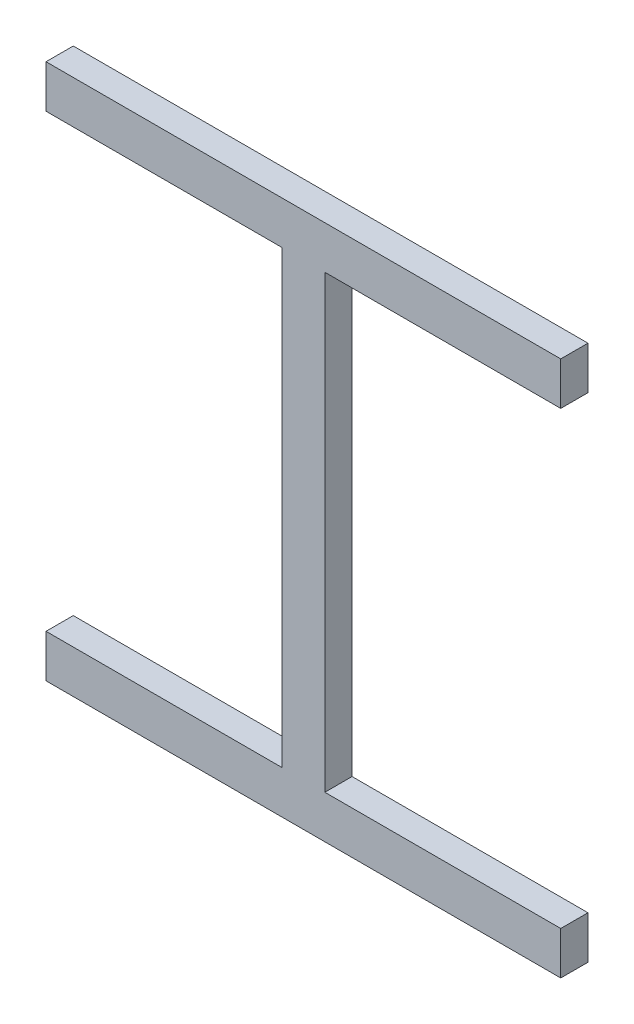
ISO-10303-21;
HEADER;
FILE_DESCRIPTION(('STEP AP214'),'2;1');
FILE_NAME('part.step','',(''),(''),'','','');
FILE_SCHEMA(('AUTOMOTIVE_DESIGN { 1 0 10303 214 1 1 1 1 }'));
ENDSEC;
DATA;
#1=APPLICATION_CONTEXT('core data for automotive mechanical design processes');
#2=APPLICATION_PROTOCOL_DEFINITION('international standard','automotive_design',2000,#1);
#3=PRODUCT_CONTEXT('',#1,'mechanical');
#4=PRODUCT('Part','Part','',(#3));
#5=PRODUCT_RELATED_PRODUCT_CATEGORY('part','',(#4));
#6=PRODUCT_DEFINITION_FORMATION('','',#4);
#7=PRODUCT_DEFINITION_CONTEXT('part definition',#1,'design');
#8=PRODUCT_DEFINITION('design','',#6,#7);
#9=PRODUCT_DEFINITION_SHAPE('','',#8);
#10=(LENGTH_UNIT() NAMED_UNIT(*) SI_UNIT(.MILLI.,.METRE.));
#11=(NAMED_UNIT(*) PLANE_ANGLE_UNIT() SI_UNIT($,.RADIAN.));
#12=(NAMED_UNIT(*) SI_UNIT($,.STERADIAN.) SOLID_ANGLE_UNIT());
#13=UNCERTAINTY_MEASURE_WITH_UNIT(LENGTH_MEASURE(1.E-05),#10,'distance_accuracy_value','');
#14=(GEOMETRIC_REPRESENTATION_CONTEXT(3) GLOBAL_UNCERTAINTY_ASSIGNED_CONTEXT((#13)) GLOBAL_UNIT_ASSIGNED_CONTEXT((#10,
#11,#12)) REPRESENTATION_CONTEXT('',''));
#15=CARTESIAN_POINT('',(0.,0.,0.));
#16=DIRECTION('',(0.,0.,1.));
#17=DIRECTION('',(1.,0.,0.));
#18=AXIS2_PLACEMENT_3D('',#15,#16,#17);
#19=CARTESIAN_POINT('',(-240.,250.,12.7));
#20=DIRECTION('',(1.,0.,0.));
#21=DIRECTION('',(0.,1.,0.));
#22=AXIS2_PLACEMENT_3D('',#19,#20,#21);
#23=PLANE('',#22);
#24=DIRECTION('',(0.,-1.,0.));
#25=VECTOR('',#24,1.);
#26=CARTESIAN_POINT('',(-240.,250.,-12.7));
#27=LINE('',#26,#25);
#28=CARTESIAN_POINT('',(-240.,250.,-12.7));
#29=VERTEX_POINT('',#28);
#30=CARTESIAN_POINT('',(-240.,210.,-12.7));
#31=VERTEX_POINT('',#30);
#32=EDGE_CURVE('E153',#29,#31,#27,.T.);
#33=ORIENTED_EDGE('',*,*,#32,.T.);
#34=DIRECTION('',(0.,0.,-1.));
#35=VECTOR('',#34,1.);
#36=CARTESIAN_POINT('',(-240.,210.,12.7));
#37=LINE('',#36,#35);
#38=CARTESIAN_POINT('',(-240.,210.,12.7));
#39=VERTEX_POINT('',#38);
#40=EDGE_CURVE('E11',#39,#31,#37,.T.);
#41=ORIENTED_EDGE('',*,*,#40,.F.);
#42=DIRECTION('',(0.,-1.,0.));
#43=VECTOR('',#42,1.);
#44=CARTESIAN_POINT('',(-240.,250.,12.7));
#45=LINE('',#44,#43);
#46=CARTESIAN_POINT('',(-240.,250.,12.7));
#47=VERTEX_POINT('',#46);
#48=EDGE_CURVE('E175',#47,#39,#45,.T.);
#49=ORIENTED_EDGE('',*,*,#48,.F.);
#50=DIRECTION('',(0.,0.,-1.));
#51=VECTOR('',#50,1.);
#52=CARTESIAN_POINT('',(-240.,250.,12.7));
#53=LINE('',#52,#51);
#54=EDGE_CURVE('E149',#47,#29,#53,.T.);
#55=ORIENTED_EDGE('',*,*,#54,.T.);
#56=EDGE_LOOP('',(#33,#41,#49,#55));
#57=FACE_BOUND('',#56,.T.);
#58=ADVANCED_FACE('F33',(#57),#23,.F.);
#59=CARTESIAN_POINT('',(-240.,210.,12.7));
#60=DIRECTION('',(0.,1.,0.));
#61=DIRECTION('',(0.,0.,1.));
#62=AXIS2_PLACEMENT_3D('',#59,#60,#61);
#63=PLANE('',#62);
#64=DIRECTION('',(1.,0.,0.));
#65=VECTOR('',#64,1.);
#66=CARTESIAN_POINT('',(-240.,210.,-12.7));
#67=LINE('',#66,#65);
#68=CARTESIAN_POINT('',(-19.9999999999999,210.,-12.7));
#69=VERTEX_POINT('',#68);
#70=EDGE_CURVE('E156',#31,#69,#67,.T.);
#71=ORIENTED_EDGE('',*,*,#70,.T.);
#72=DIRECTION('',(0.,0.,-1.));
#73=VECTOR('',#72,1.);
#74=CARTESIAN_POINT('',(-19.9999999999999,210.,12.7));
#75=LINE('',#74,#73);
#76=CARTESIAN_POINT('',(-19.9999999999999,210.,12.7));
#77=VERTEX_POINT('',#76);
#78=EDGE_CURVE('E41',#77,#69,#75,.T.);
#79=ORIENTED_EDGE('',*,*,#78,.F.);
#80=DIRECTION('',(1.,0.,0.));
#81=VECTOR('',#80,1.);
#82=CARTESIAN_POINT('',(-240.,210.,12.7));
#83=LINE('',#82,#81);
#84=EDGE_CURVE('E104',#39,#77,#83,.T.);
#85=ORIENTED_EDGE('',*,*,#84,.F.);
#86=ORIENTED_EDGE('',*,*,#40,.T.);
#87=EDGE_LOOP('',(#71,#79,#85,#86));
#88=FACE_BOUND('',#87,.T.);
#89=ADVANCED_FACE('F253',(#88),#63,.F.);
#90=CARTESIAN_POINT('',(-19.9999999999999,210.,12.7));
#91=DIRECTION('',(1.,0.,0.));
#92=DIRECTION('',(0.,0.,-1.));
#93=AXIS2_PLACEMENT_3D('',#90,#91,#92);
#94=PLANE('',#93);
#95=DIRECTION('',(0.,-1.,0.));
#96=VECTOR('',#95,1.);
#97=CARTESIAN_POINT('',(-19.9999999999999,210.,-12.7));
#98=LINE('',#97,#96);
#99=CARTESIAN_POINT('',(-19.9999999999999,-210.,-12.7));
#100=VERTEX_POINT('',#99);
#101=EDGE_CURVE('E158',#69,#100,#98,.T.);
#102=ORIENTED_EDGE('',*,*,#101,.T.);
#103=DIRECTION('',(0.,0.,-1.));
#104=VECTOR('',#103,1.);
#105=CARTESIAN_POINT('',(-19.9999999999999,-210.,12.7));
#106=LINE('',#105,#104);
#107=CARTESIAN_POINT('',(-19.9999999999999,-210.,12.7));
#108=VERTEX_POINT('',#107);
#109=EDGE_CURVE('E194',#108,#100,#106,.T.);
#110=ORIENTED_EDGE('',*,*,#109,.F.);
#111=DIRECTION('',(0.,-1.,0.));
#112=VECTOR('',#111,1.);
#113=CARTESIAN_POINT('',(-19.9999999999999,210.,12.7));
#114=LINE('',#113,#112);
#115=EDGE_CURVE('E202',#77,#108,#114,.T.);
#116=ORIENTED_EDGE('',*,*,#115,.F.);
#117=ORIENTED_EDGE('',*,*,#78,.T.);
#118=EDGE_LOOP('',(#102,#110,#116,#117));
#119=FACE_BOUND('',#118,.T.);
#120=ADVANCED_FACE('F200',(#119),#94,.F.);
#121=CARTESIAN_POINT('',(-240.,-210.,12.7));
#122=DIRECTION('',(0.,-1.,0.));
#123=DIRECTION('',(0.,0.,-1.));
#124=AXIS2_PLACEMENT_3D('',#121,#122,#123);
#125=PLANE('',#124);
#126=DIRECTION('',(-1.,0.,0.));
#127=VECTOR('',#126,1.);
#128=CARTESIAN_POINT('',(-240.,-210.,-12.7));
#129=LINE('',#128,#127);
#130=CARTESIAN_POINT('',(-240.,-210.,-12.7));
#131=VERTEX_POINT('',#130);
#132=EDGE_CURVE('E160',#100,#131,#129,.T.);
#133=ORIENTED_EDGE('',*,*,#132,.T.);
#134=DIRECTION('',(0.,0.,-1.));
#135=VECTOR('',#134,1.);
#136=CARTESIAN_POINT('',(-240.,-210.,12.7));
#137=LINE('',#136,#135);
#138=CARTESIAN_POINT('',(-240.,-210.,12.7));
#139=VERTEX_POINT('',#138);
#140=EDGE_CURVE('E191',#139,#131,#137,.T.);
#141=ORIENTED_EDGE('',*,*,#140,.F.);
#142=DIRECTION('',(-1.,0.,0.));
#143=VECTOR('',#142,1.);
#144=CARTESIAN_POINT('',(-240.,-210.,12.7));
#145=LINE('',#144,#143);
#146=EDGE_CURVE('E220',#108,#139,#145,.T.);
#147=ORIENTED_EDGE('',*,*,#146,.F.);
#148=ORIENTED_EDGE('',*,*,#109,.T.);
#149=EDGE_LOOP('',(#133,#141,#147,#148));
#150=FACE_BOUND('',#149,.T.);
#151=ADVANCED_FACE('F211',(#150),#125,.F.);
#152=CARTESIAN_POINT('',(-240.,-210.,12.7));
#153=DIRECTION('',(1.,0.,0.));
#154=DIRECTION('',(0.,1.,0.));
#155=AXIS2_PLACEMENT_3D('',#152,#153,#154);
#156=PLANE('',#155);
#157=DIRECTION('',(0.,-1.,0.));
#158=VECTOR('',#157,1.);
#159=CARTESIAN_POINT('',(-240.,-210.,-12.7));
#160=LINE('',#159,#158);
#161=CARTESIAN_POINT('',(-240.,-250.,-12.7));
#162=VERTEX_POINT('',#161);
#163=EDGE_CURVE('E162',#131,#162,#160,.T.);
#164=ORIENTED_EDGE('',*,*,#163,.T.);
#165=DIRECTION('',(0.,0.,-1.));
#166=VECTOR('',#165,1.);
#167=CARTESIAN_POINT('',(-240.,-250.,12.7));
#168=LINE('',#167,#166);
#169=CARTESIAN_POINT('',(-240.,-250.,12.7));
#170=VERTEX_POINT('',#169);
#171=EDGE_CURVE('E188',#170,#162,#168,.T.);
#172=ORIENTED_EDGE('',*,*,#171,.F.);
#173=DIRECTION('',(0.,-1.,0.));
#174=VECTOR('',#173,1.);
#175=CARTESIAN_POINT('',(-240.,-210.,12.7));
#176=LINE('',#175,#174);
#177=EDGE_CURVE('E217',#139,#170,#176,.T.);
#178=ORIENTED_EDGE('',*,*,#177,.F.);
#179=ORIENTED_EDGE('',*,*,#140,.T.);
#180=EDGE_LOOP('',(#164,#172,#178,#179));
#181=FACE_BOUND('',#180,.T.);
#182=ADVANCED_FACE('F215',(#181),#156,.F.);
#183=CARTESIAN_POINT('',(-240.,-250.,12.7));
#184=DIRECTION('',(0.,1.,0.));
#185=DIRECTION('',(-1.,0.,0.));
#186=AXIS2_PLACEMENT_3D('',#183,#184,#185);
#187=PLANE('',#186);
#188=DIRECTION('',(1.,0.,0.));
#189=VECTOR('',#188,1.);
#190=CARTESIAN_POINT('',(-240.,-250.,-12.7));
#191=LINE('',#190,#189);
#192=CARTESIAN_POINT('',(240.,-250.,-12.7));
#193=VERTEX_POINT('',#192);
#194=EDGE_CURVE('E164',#162,#193,#191,.T.);
#195=ORIENTED_EDGE('',*,*,#194,.T.);
#196=DIRECTION('',(0.,0.,-1.));
#197=VECTOR('',#196,1.);
#198=CARTESIAN_POINT('',(240.,-250.,12.7));
#199=LINE('',#198,#197);
#200=CARTESIAN_POINT('',(240.,-250.,12.7));
#201=VERTEX_POINT('',#200);
#202=EDGE_CURVE('E185',#201,#193,#199,.T.);
#203=ORIENTED_EDGE('',*,*,#202,.F.);
#204=DIRECTION('',(1.,0.,0.));
#205=VECTOR('',#204,1.);
#206=CARTESIAN_POINT('',(-240.,-250.,12.7));
#207=LINE('',#206,#205);
#208=EDGE_CURVE('E219',#170,#201,#207,.T.);
#209=ORIENTED_EDGE('',*,*,#208,.F.);
#210=ORIENTED_EDGE('',*,*,#171,.T.);
#211=EDGE_LOOP('',(#195,#203,#209,#210));
#212=FACE_BOUND('',#211,.T.);
#213=ADVANCED_FACE('F266',(#212),#187,.F.);
#214=CARTESIAN_POINT('',(240.,-210.,12.7));
#215=DIRECTION('',(-1.,0.,0.));
#216=DIRECTION('',(0.,-1.,0.));
#217=AXIS2_PLACEMENT_3D('',#214,#215,#216);
#218=PLANE('',#217);
#219=DIRECTION('',(0.,1.,0.));
#220=VECTOR('',#219,1.);
#221=CARTESIAN_POINT('',(240.,-210.,-12.7));
#222=LINE('',#221,#220);
#223=CARTESIAN_POINT('',(240.,-210.,-12.7));
#224=VERTEX_POINT('',#223);
#225=EDGE_CURVE('E166',#193,#224,#222,.T.);
#226=ORIENTED_EDGE('',*,*,#225,.T.);
#227=DIRECTION('',(0.,0.,-1.));
#228=VECTOR('',#227,1.);
#229=CARTESIAN_POINT('',(240.,-210.,12.7));
#230=LINE('',#229,#228);
#231=CARTESIAN_POINT('',(240.,-210.,12.7));
#232=VERTEX_POINT('',#231);
#233=EDGE_CURVE('E182',#232,#224,#230,.T.);
#234=ORIENTED_EDGE('',*,*,#233,.F.);
#235=DIRECTION('',(0.,1.,0.));
#236=VECTOR('',#235,1.);
#237=CARTESIAN_POINT('',(240.,-210.,12.7));
#238=LINE('',#237,#236);
#239=EDGE_CURVE('E222',#201,#232,#238,.T.);
#240=ORIENTED_EDGE('',*,*,#239,.F.);
#241=ORIENTED_EDGE('',*,*,#202,.T.);
#242=EDGE_LOOP('',(#226,#234,#240,#241));
#243=FACE_BOUND('',#242,.T.);
#244=ADVANCED_FACE('F269',(#243),#218,.F.);
#245=CARTESIAN_POINT('',(240.,-210.,12.7));
#246=DIRECTION('',(0.,-1.,0.));
#247=DIRECTION('',(1.,0.,0.));
#248=AXIS2_PLACEMENT_3D('',#245,#246,#247);
#249=PLANE('',#248);
#250=DIRECTION('',(-1.,0.,0.));
#251=VECTOR('',#250,1.);
#252=CARTESIAN_POINT('',(240.,-210.,-12.7));
#253=LINE('',#252,#251);
#254=CARTESIAN_POINT('',(19.9999999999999,-210.,-12.7));
#255=VERTEX_POINT('',#254);
#256=EDGE_CURVE('E168',#224,#255,#253,.T.);
#257=ORIENTED_EDGE('',*,*,#256,.T.);
#258=DIRECTION('',(0.,0.,-1.));
#259=VECTOR('',#258,1.);
#260=CARTESIAN_POINT('',(19.9999999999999,-210.,12.7));
#261=LINE('',#260,#259);
#262=CARTESIAN_POINT('',(19.9999999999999,-210.,12.7));
#263=VERTEX_POINT('',#262);
#264=EDGE_CURVE('E179',#263,#255,#261,.T.);
#265=ORIENTED_EDGE('',*,*,#264,.F.);
#266=DIRECTION('',(-1.,0.,0.));
#267=VECTOR('',#266,1.);
#268=CARTESIAN_POINT('',(240.,-210.,12.7));
#269=LINE('',#268,#267);
#270=EDGE_CURVE('E228',#232,#263,#269,.T.);
#271=ORIENTED_EDGE('',*,*,#270,.F.);
#272=ORIENTED_EDGE('',*,*,#233,.T.);
#273=EDGE_LOOP('',(#257,#265,#271,#272));
#274=FACE_BOUND('',#273,.T.);
#275=ADVANCED_FACE('F234',(#274),#249,.F.);
#276=CARTESIAN_POINT('',(19.9999999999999,210.,12.7));
#277=DIRECTION('',(-1.,0.,0.));
#278=DIRECTION('',(0.,0.,1.));
#279=AXIS2_PLACEMENT_3D('',#276,#277,#278);
#280=PLANE('',#279);
#281=DIRECTION('',(0.,1.,0.));
#282=VECTOR('',#281,1.);
#283=CARTESIAN_POINT('',(19.9999999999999,210.,-12.7));
#284=LINE('',#283,#282);
#285=CARTESIAN_POINT('',(19.9999999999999,210.,-12.7));
#286=VERTEX_POINT('',#285);
#287=EDGE_CURVE('E170',#255,#286,#284,.T.);
#288=ORIENTED_EDGE('',*,*,#287,.T.);
#289=DIRECTION('',(0.,0.,-1.));
#290=VECTOR('',#289,1.);
#291=CARTESIAN_POINT('',(19.9999999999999,210.,12.7));
#292=LINE('',#291,#290);
#293=CARTESIAN_POINT('',(19.9999999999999,210.,12.7));
#294=VERTEX_POINT('',#293);
#295=EDGE_CURVE('E144',#294,#286,#292,.T.);
#296=ORIENTED_EDGE('',*,*,#295,.F.);
#297=DIRECTION('',(0.,1.,0.));
#298=VECTOR('',#297,1.);
#299=CARTESIAN_POINT('',(19.9999999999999,210.,12.7));
#300=LINE('',#299,#298);
#301=EDGE_CURVE('E135',#263,#294,#300,.T.);
#302=ORIENTED_EDGE('',*,*,#301,.F.);
#303=ORIENTED_EDGE('',*,*,#264,.T.);
#304=EDGE_LOOP('',(#288,#296,#302,#303));
#305=FACE_BOUND('',#304,.T.);
#306=ADVANCED_FACE('F238',(#305),#280,.F.);
#307=CARTESIAN_POINT('',(240.,210.,12.7));
#308=DIRECTION('',(0.,1.,0.));
#309=DIRECTION('',(-1.,0.,0.));
#310=AXIS2_PLACEMENT_3D('',#307,#308,#309);
#311=PLANE('',#310);
#312=DIRECTION('',(1.,0.,0.));
#313=VECTOR('',#312,1.);
#314=CARTESIAN_POINT('',(240.,210.,-12.7));
#315=LINE('',#314,#313);
#316=CARTESIAN_POINT('',(240.,210.,-12.7));
#317=VERTEX_POINT('',#316);
#318=EDGE_CURVE('E143',#286,#317,#315,.T.);
#319=ORIENTED_EDGE('',*,*,#318,.T.);
#320=DIRECTION('',(0.,0.,-1.));
#321=VECTOR('',#320,1.);
#322=CARTESIAN_POINT('',(240.,210.,12.7));
#323=LINE('',#322,#321);
#324=CARTESIAN_POINT('',(240.,210.,12.7));
#325=VERTEX_POINT('',#324);
#326=EDGE_CURVE('E140',#325,#317,#323,.T.);
#327=ORIENTED_EDGE('',*,*,#326,.F.);
#328=DIRECTION('',(1.,0.,0.));
#329=VECTOR('',#328,1.);
#330=CARTESIAN_POINT('',(240.,210.,12.7));
#331=LINE('',#330,#329);
#332=EDGE_CURVE('E129',#294,#325,#331,.T.);
#333=ORIENTED_EDGE('',*,*,#332,.F.);
#334=ORIENTED_EDGE('',*,*,#295,.T.);
#335=EDGE_LOOP('',(#319,#327,#333,#334));
#336=FACE_BOUND('',#335,.T.);
#337=ADVANCED_FACE('F141',(#336),#311,.F.);
#338=CARTESIAN_POINT('',(240.,250.,12.7));
#339=DIRECTION('',(-1.,0.,0.));
#340=DIRECTION('',(0.,-1.,0.));
#341=AXIS2_PLACEMENT_3D('',#338,#339,#340);
#342=PLANE('',#341);
#343=DIRECTION('',(0.,1.,0.));
#344=VECTOR('',#343,1.);
#345=CARTESIAN_POINT('',(240.,250.,-12.7));
#346=LINE('',#345,#344);
#347=CARTESIAN_POINT('',(240.,250.,-12.7));
#348=VERTEX_POINT('',#347);
#349=EDGE_CURVE('E90',#317,#348,#346,.T.);
#350=ORIENTED_EDGE('',*,*,#349,.T.);
#351=DIRECTION('',(0.,0.,-1.));
#352=VECTOR('',#351,1.);
#353=CARTESIAN_POINT('',(240.,250.,12.7));
#354=LINE('',#353,#352);
#355=CARTESIAN_POINT('',(240.,250.,12.7));
#356=VERTEX_POINT('',#355);
#357=EDGE_CURVE('E145',#356,#348,#354,.T.);
#358=ORIENTED_EDGE('',*,*,#357,.F.);
#359=DIRECTION('',(0.,1.,0.));
#360=VECTOR('',#359,1.);
#361=CARTESIAN_POINT('',(240.,250.,12.7));
#362=LINE('',#361,#360);
#363=EDGE_CURVE('E133',#325,#356,#362,.T.);
#364=ORIENTED_EDGE('',*,*,#363,.F.);
#365=ORIENTED_EDGE('',*,*,#326,.T.);
#366=EDGE_LOOP('',(#350,#358,#364,#365));
#367=FACE_BOUND('',#366,.T.);
#368=ADVANCED_FACE('F147',(#367),#342,.F.);
#369=CARTESIAN_POINT('',(-240.,250.,12.7));
#370=DIRECTION('',(0.,-1.,0.));
#371=DIRECTION('',(1.,0.,0.));
#372=AXIS2_PLACEMENT_3D('',#369,#370,#371);
#373=PLANE('',#372);
#374=DIRECTION('',(-1.,0.,0.));
#375=VECTOR('',#374,1.);
#376=CARTESIAN_POINT('',(-240.,250.,-12.7));
#377=LINE('',#376,#375);
#378=EDGE_CURVE('E96',#348,#29,#377,.T.);
#379=ORIENTED_EDGE('',*,*,#378,.T.);
#380=ORIENTED_EDGE('',*,*,#54,.F.);
#381=DIRECTION('',(-1.,0.,0.));
#382=VECTOR('',#381,1.);
#383=CARTESIAN_POINT('',(-240.,250.,12.7));
#384=LINE('',#383,#382);
#385=EDGE_CURVE('E49',#356,#47,#384,.T.);
#386=ORIENTED_EDGE('',*,*,#385,.F.);
#387=ORIENTED_EDGE('',*,*,#357,.T.);
#388=EDGE_LOOP('',(#379,#380,#386,#387));
#389=FACE_BOUND('',#388,.T.);
#390=ADVANCED_FACE('F242',(#389),#373,.F.);
#391=CARTESIAN_POINT('',(-240.,210.,12.7));
#392=DIRECTION('',(0.,0.,1.));
#393=DIRECTION('',(1.,0.,0.));
#394=AXIS2_PLACEMENT_3D('',#391,#392,#393);
#395=PLANE('',#394);
#396=ORIENTED_EDGE('',*,*,#48,.T.);
#397=ORIENTED_EDGE('',*,*,#84,.T.);
#398=ORIENTED_EDGE('',*,*,#115,.T.);
#399=ORIENTED_EDGE('',*,*,#146,.T.);
#400=ORIENTED_EDGE('',*,*,#177,.T.);
#401=ORIENTED_EDGE('',*,*,#208,.T.);
#402=ORIENTED_EDGE('',*,*,#239,.T.);
#403=ORIENTED_EDGE('',*,*,#270,.T.);
#404=ORIENTED_EDGE('',*,*,#301,.T.);
#405=ORIENTED_EDGE('',*,*,#332,.T.);
#406=ORIENTED_EDGE('',*,*,#363,.T.);
#407=ORIENTED_EDGE('',*,*,#385,.T.);
#408=EDGE_LOOP('',(#396,#397,#398,#399,#400,#401,#402,#403,#404,#405,#406,#407));
#409=FACE_BOUND('',#408,.T.);
#410=ADVANCED_FACE('F131',(#409),#395,.T.);
#411=CARTESIAN_POINT('',(-240.,210.,-12.7));
#412=DIRECTION('',(0.,0.,1.));
#413=DIRECTION('',(1.,0.,0.));
#414=AXIS2_PLACEMENT_3D('',#411,#412,#413);
#415=PLANE('',#414);
#416=ORIENTED_EDGE('',*,*,#32,.F.);
#417=ORIENTED_EDGE('',*,*,#378,.F.);
#418=ORIENTED_EDGE('',*,*,#349,.F.);
#419=ORIENTED_EDGE('',*,*,#318,.F.);
#420=ORIENTED_EDGE('',*,*,#287,.F.);
#421=ORIENTED_EDGE('',*,*,#256,.F.);
#422=ORIENTED_EDGE('',*,*,#225,.F.);
#423=ORIENTED_EDGE('',*,*,#194,.F.);
#424=ORIENTED_EDGE('',*,*,#163,.F.);
#425=ORIENTED_EDGE('',*,*,#132,.F.);
#426=ORIENTED_EDGE('',*,*,#101,.F.);
#427=ORIENTED_EDGE('',*,*,#70,.F.);
#428=EDGE_LOOP('',(#416,#417,#418,#419,#420,#421,#422,#423,#424,#425,#426,#427));
#429=FACE_BOUND('',#428,.T.);
#430=ADVANCED_FACE('F206',(#429),#415,.F.);
#431=CLOSED_SHELL('',(#58,#89,#120,#151,#182,#213,#244,#275,#306,#337,#368,#390,#410,#430));
#432=MANIFOLD_SOLID_BREP('B2',#431);
#433=ADVANCED_BREP_SHAPE_REPRESENTATION('',(#18,#432),#14);
#434=SHAPE_DEFINITION_REPRESENTATION(#9,#433);
ENDSEC;
END-ISO-10303-21;
